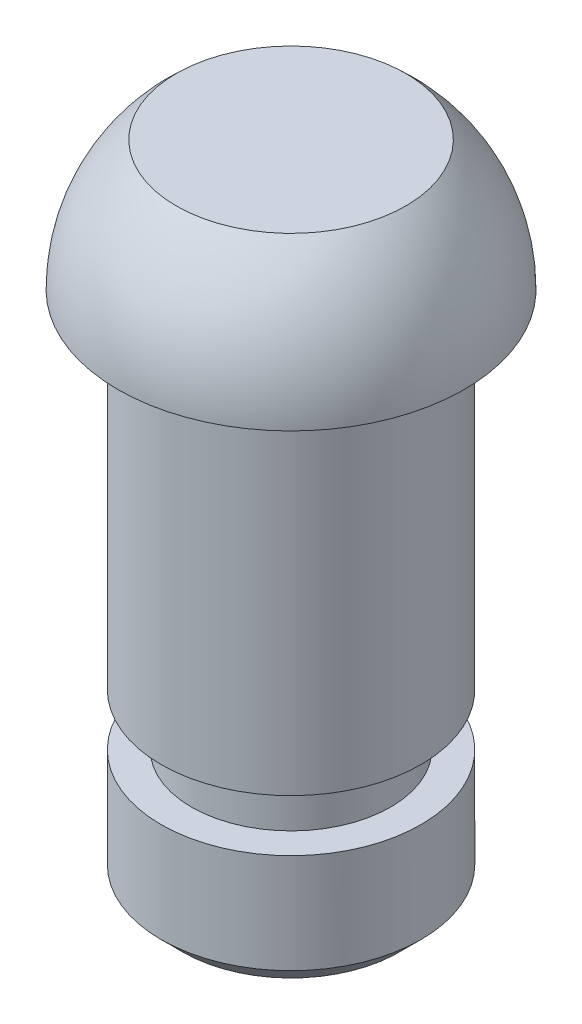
from build123d import *

# Parameters (mm, degrees)
CHAMFER1_SIZE = 0.25


with BuildPart() as part:
    # Sketch1 → Revolve1 (revolve)
    with BuildSketch(Plane.XY, mode=Mode.PRIVATE) as revolve1_sk:
        with BuildLine():
            Line((-1.325, 2.76692963), (0, 2.76692963))
            Line((0, 2.76692963), (0, -4.731194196))
            Line((0, -4.731194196), (-1.5, -4.731194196))
            Line((-1.5, -4.731194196), (-1.5, -3.331194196))
            Line((-1.5, -3.331194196), (-1.15, -3.331194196))
            Line((-1.15, -3.331194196), (-1.15, -2.731194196))
            Line((-1.15, -2.731194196), (-1.5, -2.731194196))
            Line((-1.5, -2.731194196), (-1.5, 1.268805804))
            Line((-1.5, 1.268805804), (-2, 1.268805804))
            ThreePointArc((-2, 1.268805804), (-1.823458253, 2.09038964), (-1.325, 2.76692963))
        make_face()
    revolve(revolve1_sk.sketch.rotate(Axis((0, 0, 0), (0, -1, 0)), 270), axis=Axis((0, 0, 0), (0, -1, 0)))

    # Chamfer1
    chamfer1_edges = [part.edges().sort_by_distance(p)[0] for p in [
        (0, -4.731194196, -1.5),
    ]]
    chamfer(chamfer1_edges, length=CHAMFER1_SIZE)


solid = part.part
